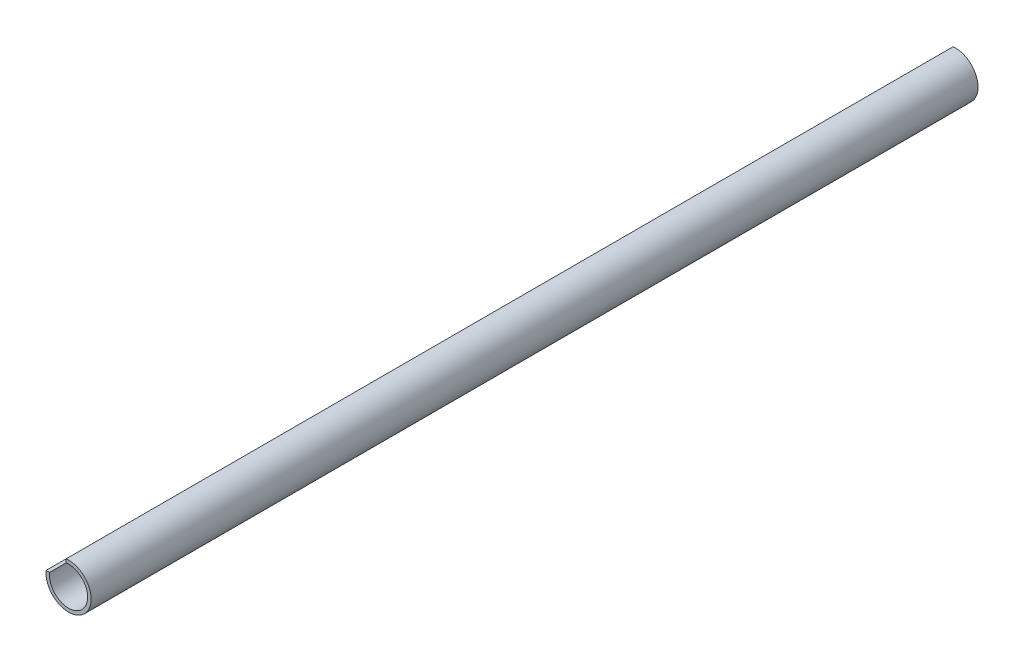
from build123d import *

# Parameters (mm, degrees)
ESQUISSE1_R             = 13
ESQUISSE1_R_2           = 11
BASE_EXTRUSION_DEPTH    = 511.175
ENL_V_MAT_EXTRU_1_DEPTH = 512.505504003


with BuildPart() as part:
    # Esquisse1 → Base-Extrusion (new body)
    with BuildSketch(Plane.XY):
        Circle(ESQUISSE1_R)
        Circle(ESQUISSE1_R_2, mode=Mode.SUBTRACT)
    extrude(amount=BASE_EXTRUSION_DEPTH)

    # Esquisse2 → Enl_v. mat.-Extru.1 (cut, through all)
    with BuildSketch(Plane.XY.offset(511.175)):
        Polygon((-1.414213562, 1.414213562), (-1.414213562, 24.585786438), (-24.585786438, 1.414213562), align=None)
    extrude(amount=-ENL_V_MAT_EXTRU_1_DEPTH, mode=Mode.SUBTRACT)


solid = part.part
